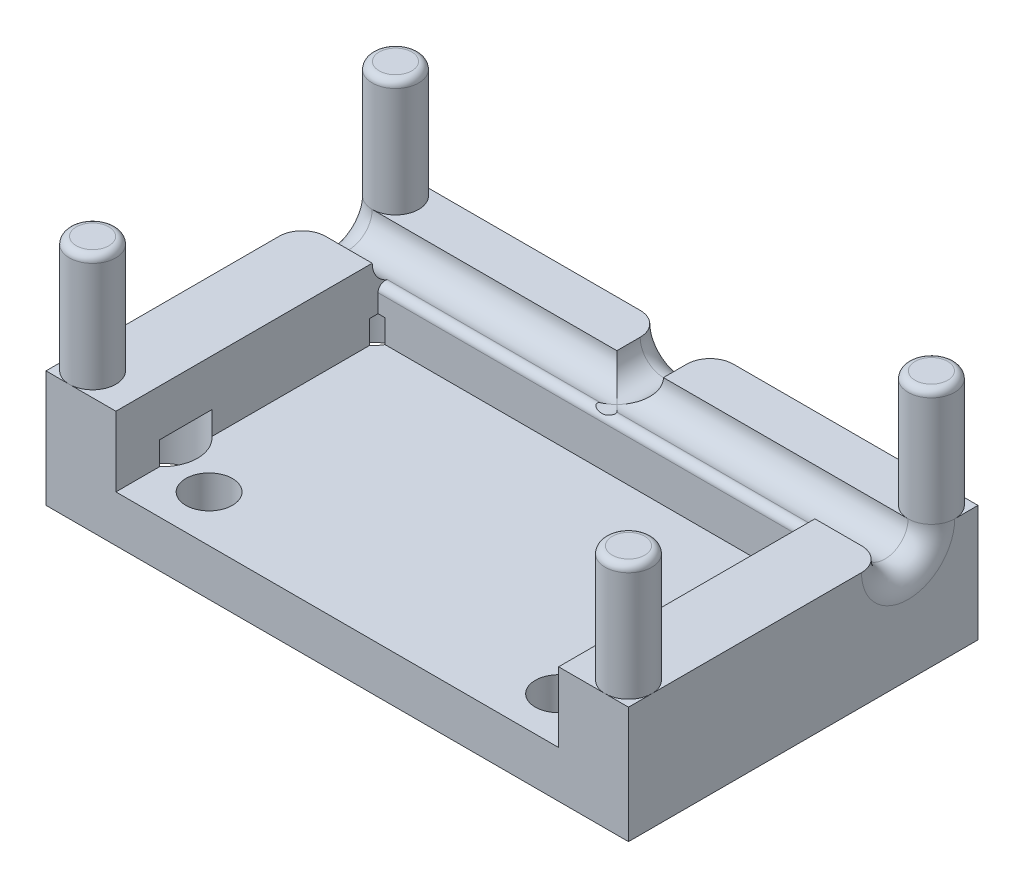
from build123d import *

# Parameters (mm, degrees)
SKETCH1_W               = 25
SKETCH1_H               = 15
BOSS_EXTRUDE1_DEPTH     = 5
CUT_EXTRUDE1_DEPTH      = 27.575364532
CUT_EXTRUDE1_DEPTH_BACK = 27.575364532
SKETCH2_R               = 1
FILLET1_R               = 1
SKETCH3_R               = 1
BOSS_EXTRUDE2_DEPTH     = 5
SKETCH4_W               = 19
SKETCH4_H               = 11.25
CUT_EXTRUDE2_DEPTH      = 3
SKETCH5_R               = 1
CUT_EXTRUDE3_DEPTH      = 3
FILLET2_R               = 0.3
FILLET3_R               = 0.3
CUT_EXTRUDE4_DEPTH      = 18.677669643
CUT_EXTRUDE4_DEPTH_BACK = 3
SKETCH6_R               = 1.5
CUT_EXTRUDE5_DEPTH      = 22.937411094
CUT_EXTRUDE5_DEPTH_BACK = 22.937411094
SKETCH7_R               = 1
FILLET4_R               = 1


with BuildPart() as part:
    # Sketch1 → Boss-Extrude1 (new body)
    with BuildSketch(Plane(origin=(0, 0, 0), x_dir=(1, 0, 0), z_dir=(0, 1, 0))):
        Rectangle(SKETCH1_W, SKETCH1_H)
    extrude(amount=BOSS_EXTRUDE1_DEPTH)

    # Sketch2 → Cut-Extrude1 (cut, two sides: drawn at the far end of the back side and taken through both)
    with BuildSketch(Plane.ZY.offset(12.5).offset(-CUT_EXTRUDE1_DEPTH_BACK)):
        with Locations((-4.5, 5)):
            Circle(SKETCH2_R)
    extrude(amount=CUT_EXTRUDE1_DEPTH + CUT_EXTRUDE1_DEPTH_BACK, mode=Mode.SUBTRACT)

    # Fillet1
    fillet1_edges = [part.edges().sort_by_distance(p)[0] for p in [
        (12.5, 4, -4.5),
        (-12.5, 4, -4.5),
    ]]
    fillet(fillet1_edges, radius=FILLET1_R)

    # Sketch3 → Boss-Extrude2 (add)
    with BuildSketch(Plane(origin=(0, 5, 0), x_dir=(1, 0, 0), z_dir=(0, 1, 0))):
        with Locations(Location((-11.5, 6.5, 0), (0, 0, 270))):
            Circle(SKETCH3_R)
        with Locations(Location((11.5, 6.5, 0), (0, 0, 90))):
            Circle(SKETCH3_R)
        with Locations(Location((11.5, -6.5, 0), (0, 0, 270))):
            Circle(SKETCH3_R)
        with Locations(Location((-11.5, -6.5, 0), (0, 0, 90))):
            Circle(SKETCH3_R)
    extrude(amount=BOSS_EXTRUDE2_DEPTH)

    # Sketch4 → Cut-Extrude2 (cut)
    with BuildSketch(Plane(origin=(0, 5, 0), x_dir=(1, 0, 0), z_dir=(0, 1, 0))):
        with Locations((0, -1.875)):
            Rectangle(SKETCH4_W, SKETCH4_H)
    extrude(amount=-CUT_EXTRUDE2_DEPTH, mode=Mode.SUBTRACT)

    # Sketch5 → Cut-Extrude3 (cut)
    with BuildSketch(Plane(origin=(0, 2, 0), x_dir=(1, 0, 0), z_dir=(0, 1, 0))):
        with Locations(Location((-7.5, -5.5, 0), (0, 0, 270))):
            Circle(SKETCH5_R)
        with Locations(Location((7.5, -5.5, 0), (0, 0, 270))):
            Circle(SKETCH5_R)
    extrude(amount=-CUT_EXTRUDE3_DEPTH, mode=Mode.SUBTRACT)

    # Fillet2
    fillet2_edges = [part.edges().sort_by_distance(p)[0] for p in [
        (-11.5, 10, -7.5),
        (11.5, 10, -5.5),
        (11.5, 10, 5.5),
        (-11.5, 10, 7.5),
    ]]
    fillet(fillet2_edges, radius=FILLET2_R)

    # Fillet3
    fillet3_edges = [part.edges().sort_by_distance(p)[0] for p in [
        (0, 4.338562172, -3.75),
    ]]
    fillet(fillet3_edges, radius=FILLET3_R)

    # Sketch6 → Cut-Extrude4 (cut, two sides: drawn at the far end of the back side and taken through both)
    with BuildSketch(Plane.XZ.offset(-CUT_EXTRUDE4_DEPTH_BACK)):
        with Locations(Location((-10.5, 4.5, 0), (0, 0, 90))):
            Circle(SKETCH6_R)
        with Locations(Location((10.5, 4.5, 0), (0, 0, 90))):
            Circle(SKETCH6_R)
        with Locations(Location((10.5, -4.5, 0), (0, 0, 90))):
            Circle(SKETCH6_R)
        with Locations(Location((-10.5, -4.5, 0), (0, 0, 90))):
            Circle(SKETCH6_R)
    extrude(amount=CUT_EXTRUDE4_DEPTH + CUT_EXTRUDE4_DEPTH_BACK, mode=Mode.SUBTRACT)

    # Sketch7 → Cut-Extrude5 (cut, two sides: drawn at the far end of the back side and taken through both)
    with BuildSketch(Plane(origin=(0, 0, -7.5), x_dir=(-1, 0, 0), z_dir=(0, 0, -1)).offset(-CUT_EXTRUDE5_DEPTH_BACK)):
        with Locations((0, 5)):
            Circle(SKETCH7_R)
    extrude(amount=CUT_EXTRUDE5_DEPTH + CUT_EXTRUDE5_DEPTH_BACK, mode=Mode.SUBTRACT)

    # Fillet4
    fillet4_edges = [part.edges().sort_by_distance(p)[0] for p in [
        (0, 4, -7.5),
    ]]
    fillet(fillet4_edges, radius=FILLET4_R)


solid = part.part
